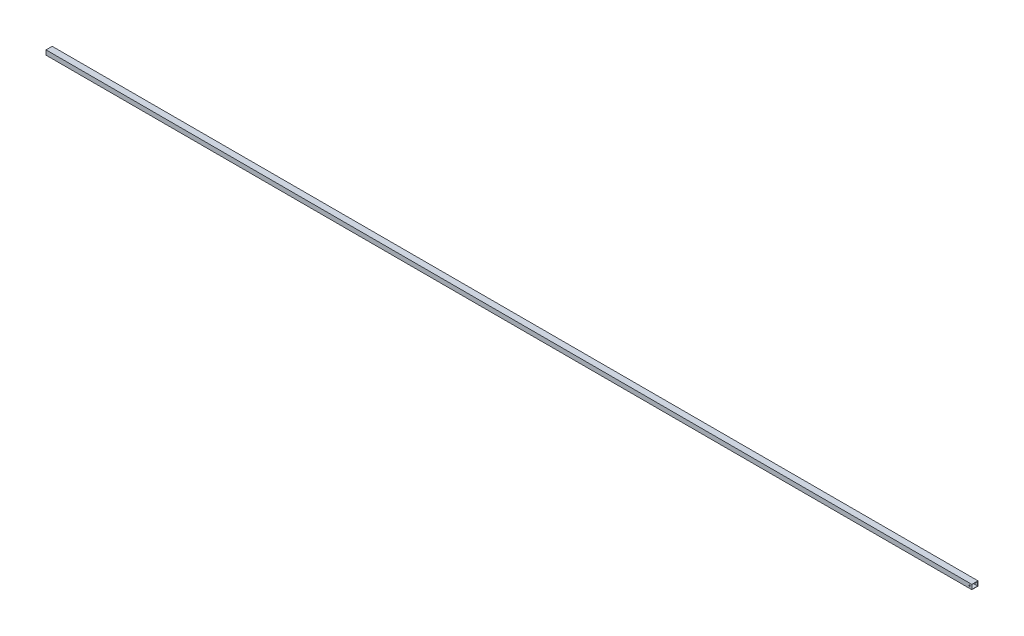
from build123d import *

# Parameters (mm, degrees)
SKETCH1_W           = 40
SKETCH1_H           = 30
SKETCH1_W_2         = 36
SKETCH1_H_2         = 26
BOSS_EXTRUDE1_DEPTH = 6000
SKETCH2_R           = 4
CUT_EXTRUDE1_DEPTH  = 6001.208329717


with BuildPart() as part:
    # Sketch1 → Boss-Extrude1 (new body)
    with BuildSketch(Plane(origin=(0, 0, 0), x_dir=(0, 0, -1), z_dir=(1, 0, 0))):
        with Locations((20, 15)):
            Rectangle(SKETCH1_W, SKETCH1_H)
        with Locations((20, 15)):
            Rectangle(SKETCH1_W_2, SKETCH1_H_2, mode=Mode.SUBTRACT)
    extrude(amount=-BOSS_EXTRUDE1_DEPTH)

    # Sketch2 → Cut-Extrude1 (cut, through all)
    with BuildSketch(Plane.XY):
        with Locations((-15, 15)):
            Circle(SKETCH2_R)
    extrude(amount=-CUT_EXTRUDE1_DEPTH, mode=Mode.SUBTRACT)


solid = part.part
